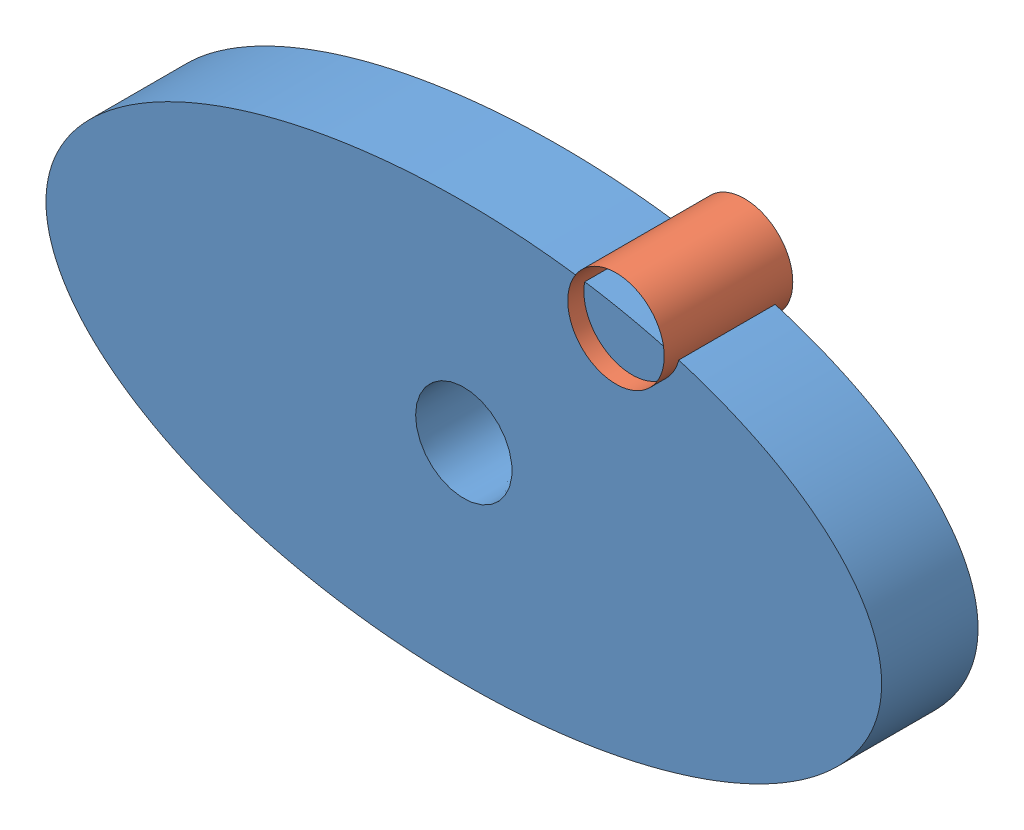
SolidWorks assembly ZU BG 1.SLDASM, configuration Standard (file format 3400). Lengths in mm.
Overall size (130 69.75 20).
2 component instances, 2 part files, 2 mates.
Components (placement in the parent):
- ZU1-1: ZU1.SLDPRT [Standard] at origin size (130 65 15)
- Hilfsglied-1: Hilfsglied.SLDPRT [Standard] at (26.1782 29.7477 0) size (15 15 20)
Mates (geometry in assembly coordinates):
- Deckungsgleich1: coincident aligned: plane of ?; plane of assembly
- Deckungsgleich2: coincident: face of ?; point of ?
